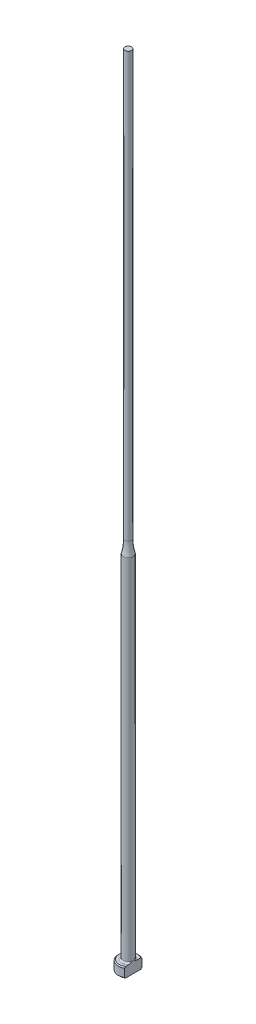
from build123d import *
from build123d.topology import SkipClean

# Parameters (mm, degrees)
CHAMFER1_SIZE = 0.2
FILLET1_R     = 0.3
KEY_DEPTH     = 161.024998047


with BuildPart() as part:
    # Sketch1 → Revolve1 (revolve)
    with BuildSketch(Plane.XY, mode=Mode.PRIVATE) as revolve1_sk:
        with BuildLine():
            Line((0, 0), (-2, 0))
            Line((-2, 0), (-2, 2))
            Line((-2, 2), (-1, 2))
            Line((-1, 2), (-1, 72.377501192))
            ThreePointArc((-1, 72.377501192), (-0.737886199, 73.677124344), (-0.65, 75))
            Line((-0.65, 75), (-0.65, 160))
            Line((-0.65, 160), (0, 160))
            Line((0, 160), (0, 0))
        make_face()
    revolve(revolve1_sk.sketch.rotate(Axis((0, 259.958771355, 0), (0, -1, 0)), 270), axis=Axis((0, 259.958771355, 0), (0, -1, 0)))

    # Chamfer1
    chamfer1_edges = [part.edges().sort_by_distance(p)[0] for p in [
        (0, 0, -2),
        (0, 2, -2),
    ]]
    chamfer(chamfer1_edges, length=CHAMFER1_SIZE)

    # Fillet1
    fillet1_edges = [part.edges().sort_by_distance(p)[0] for p in [
        (0, 2, -1),
    ]]
    fillet(fillet1_edges, radius=FILLET1_R)

    # Sketch2 → KEY (cut, through all)
    with SkipClean():  # the faces are left unmerged after this step: merging them gives an invalid solid
        with BuildSketch(Plane(origin=(0, 0, 0), x_dir=(1, 0, 0), z_dir=(0, 1, 0))):
            with BuildLine():
                Line((1, 1.732050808), (1, -1.732050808))
                ThreePointArc((1, -1.732050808), (2, 0), (1, 1.732050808))
            make_face()
        extrude(amount=KEY_DEPTH, mode=Mode.SUBTRACT)


solid = part.part
